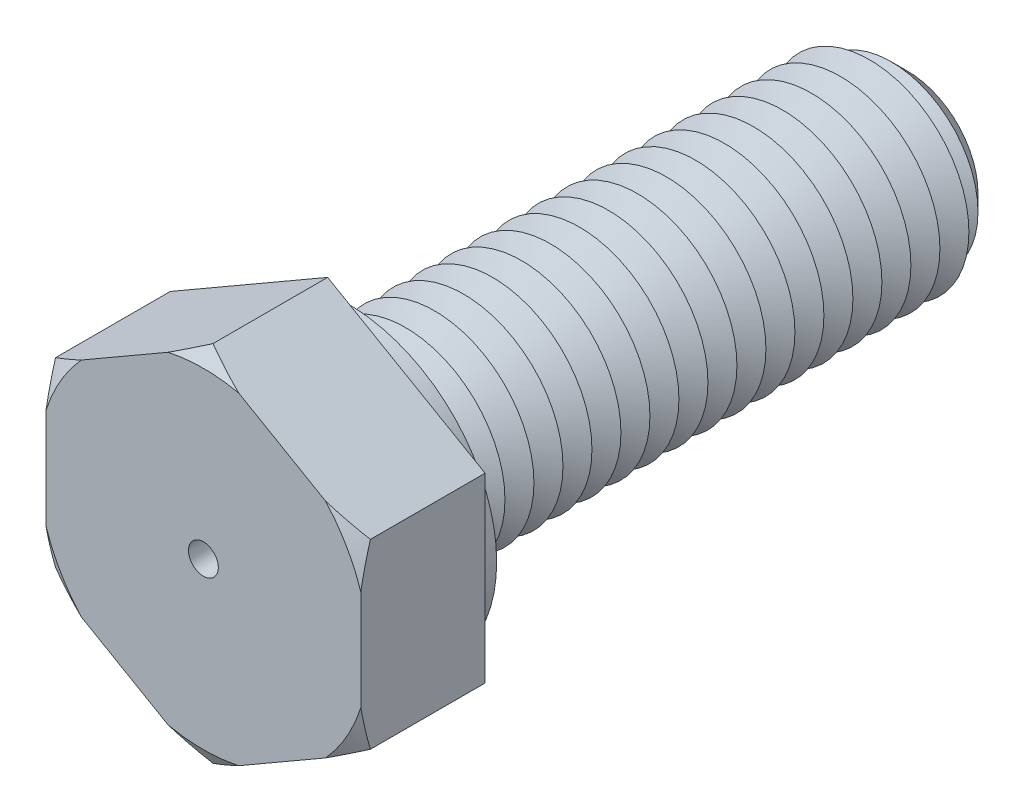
from build123d import *

# Parameters (mm, degrees)
BOSS_EXTRUDE1_DEPTH = 7.5
SKETCH3_R           = 6
BOSS_EXTRUDE2_DEPTH = 35
SKETCH4_R           = 9
BOSS_EXTRUDE3_DEPTH = 1.2
CHAMFER1_SIZE       = 1.75
LPATTERN1_COUNT     = 19
LPATTERN1_PITCH     = 1.75
SKETCH8_R           = 0.9
CUT_EXTRUDE1_DEPTH  = 42.5


with BuildPart() as part:
    # Sketch2 → Boss-Extrude1 (new body)
    with BuildSketch(Plane.XY):
        Polygon((0, 10.969655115), (-9.5, 5.484827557), (-9.5, -5.484827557), (0, -10.969655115), (9.5, -5.484827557), (9.5, 5.484827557), align=None)
    extrude(amount=BOSS_EXTRUDE1_DEPTH)

    # Sketch3 → Boss-Extrude2 (add)
    with BuildSketch(Plane(origin=(0, 0, 0), x_dir=(-1, 0, 0), z_dir=(0, 0, -1))):
        Circle(SKETCH3_R)
    extrude(amount=BOSS_EXTRUDE2_DEPTH)

    # Sketch4 → Boss-Extrude3 (add)
    with BuildSketch(Plane(origin=(0, 0, 0), x_dir=(-1, 0, 0), z_dir=(0, 0, -1))):
        with Locations(Location((0, 0, 0), (0, 0, 180))):
            Circle(SKETCH4_R)
    extrude(amount=BOSS_EXTRUDE3_DEPTH)

    # Chamfer1
    chamfer1_edges = [part.edges().sort_by_distance(p)[0] for p in [
        (6, 0, -35),
    ]]
    chamfer(chamfer1_edges, length=CHAMFER1_SIZE)

    # Sketch6 → Cut-Revolve1 (revolve, cut)
    with BuildSketch(Plane(origin=(0, 0, 0), x_dir=(0, 0, -1), z_dir=(1, 0, 0)), mode=Mode.PRIVATE) as cut_revolve1_sk:
        Polygon((1.2, 6), (2.075, 4.484455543), (2.95, 6), align=None)
    cut_revolve1 = revolve(cut_revolve1_sk.sketch.rotate(Axis((0, 0, 3.211670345), (0, 0, -1)), 90), axis=Axis((0, 0, 3.211670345), (0, 0, -1)), mode=Mode.SUBTRACT)

    # LPattern1: Cut-Revolve1 ×19
    with Locations(*[(0, 0, -i * LPATTERN1_PITCH) for i in range(1, LPATTERN1_COUNT)]):
        add(cut_revolve1, mode=Mode.SUBTRACT)

    # Sketch7 → Cut-Revolve2 (revolve, cut)
    with BuildSketch(Plane(origin=(0, 0, 0), x_dir=(0, 0, -1), z_dir=(1, 0, 0)), mode=Mode.PRIVATE) as cut_revolve2_sk:
        Polygon((-7.5, 10.969655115), (-7.5, 9.969655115), (-6.922649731, 10.969655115), align=None)
    revolve(cut_revolve2_sk.sketch.rotate(Axis((0, 0, 3.211670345), (0, 0, -1)), 90), axis=Axis((0, 0, 3.211670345), (0, 0, -1)), mode=Mode.SUBTRACT)

    # Sketch8 → Cut-Extrude1 (cut)
    with BuildSketch(Plane.XY.offset(7.5)):
        Circle(SKETCH8_R)
    extrude(amount=-CUT_EXTRUDE1_DEPTH, mode=Mode.SUBTRACT)


solid = part.part
